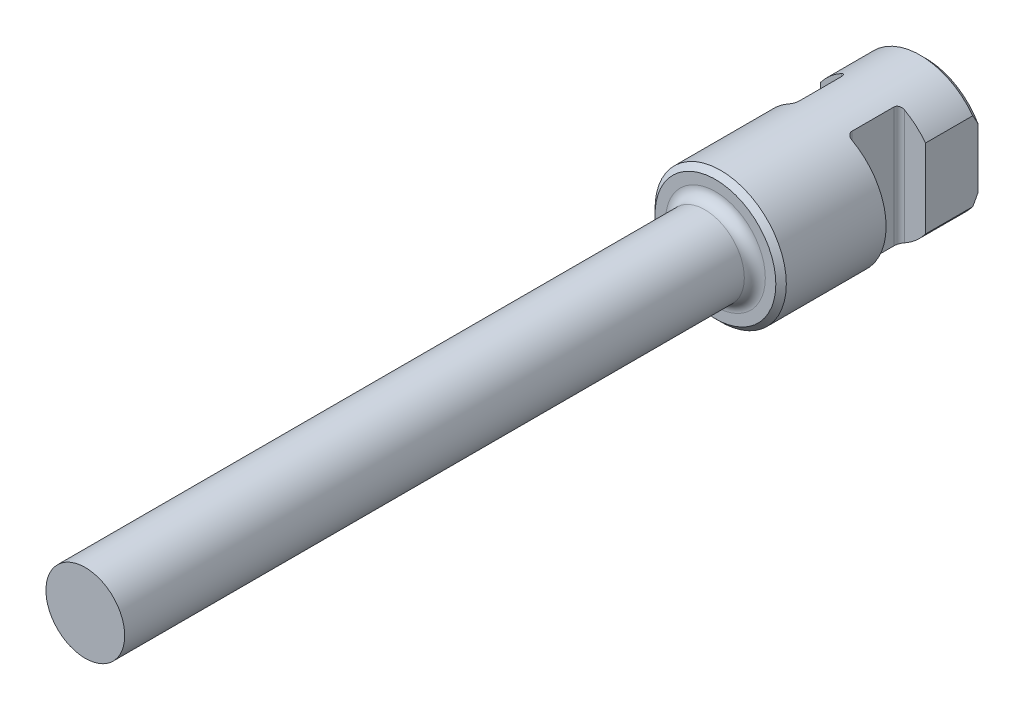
from build123d import *

# Parameters (mm, degrees)
ESQUISSE1_R             = 2.5
BOSS_EXTRU_1_DEPTH      = 8
ESQUISSE2_R             = 1.5
BOSS_EXTRU_2_DEPTH      = 24
CONG_1_R                = 0.4
CHANFREIN1_SIZE         = 0.2
ESQUISSE3_W             = 2
ESQUISSE3_H             = 6
ENL_V_MAT_EXTRU_1_DEPTH = 4
ESQUISSE4_W             = 2
ESQUISSE4_H             = 6
ENL_V_MAT_EXTRU_2_DEPTH = 2
CONG_2_R                = 0.2
CHANFREIN2_SIZE         = 0.2


with BuildPart() as part:
    # Esquisse1 → Boss.-Extru.1 (new body)
    with BuildSketch(Plane.XY):
        Circle(ESQUISSE1_R)
    extrude(amount=BOSS_EXTRU_1_DEPTH)

    # Esquisse2 → Boss.-Extru.2 (add)
    with BuildSketch(Plane.XY.offset(8)):
        Circle(ESQUISSE2_R)
    extrude(amount=BOSS_EXTRU_2_DEPTH)

    # Cong_1
    cong_1_edges = [part.edges().sort_by_distance(p)[0] for p in [
        (-1.5, 0, 8),
    ]]
    fillet(cong_1_edges, radius=CONG_1_R)

    # Chanfrein1
    chanfrein1_edges = [part.edges().sort_by_distance(p)[0] for p in [
        (-2.5, 0, 0),
    ]]
    chamfer(chanfrein1_edges, length=CHANFREIN1_SIZE)

    # Esquisse3 → Enl_v. mat.-Extru.1 (cut)
    with BuildSketch(Plane(origin=(0, 0, 0), x_dir=(-1, 0, 0), z_dir=(0, 0, -1))):
        with Locations((-3, 0)):
            Rectangle(ESQUISSE3_W, ESQUISSE3_H)
        with Locations((3, 0)):
            Rectangle(ESQUISSE3_W, ESQUISSE3_H)
    extrude(amount=-ENL_V_MAT_EXTRU_1_DEPTH, mode=Mode.SUBTRACT)

    # Esquisse4 → Enl_v. mat.-Extru.2 (cut)
    with BuildSketch(Plane(origin=(0, 0, 4), x_dir=(-1, 0, 0), z_dir=(0, 0, -1))):
        with Locations((-2, 0)):
            Rectangle(ESQUISSE4_W, ESQUISSE4_H)
        with Locations((2, 0)):
            Rectangle(ESQUISSE4_W, ESQUISSE4_H)
    extrude(amount=ENL_V_MAT_EXTRU_2_DEPTH, mode=Mode.SUBTRACT)

    # Cong_2
    cong_2_edges = [part.edges().sort_by_distance(p)[0] for p in [
        (1, 0, 4),
        (1, 0, 2),
        (-1, 0, 4),
        (-1, 0, 2),
    ]]
    fillet(cong_2_edges, radius=CONG_2_R)

    # Chanfrein2
    chanfrein2_edges = [part.edges().sort_by_distance(p)[0] for p in [
        (-2.5, 0, 8),
    ]]
    chamfer(chanfrein2_edges, length=CHANFREIN2_SIZE)


solid = part.part
